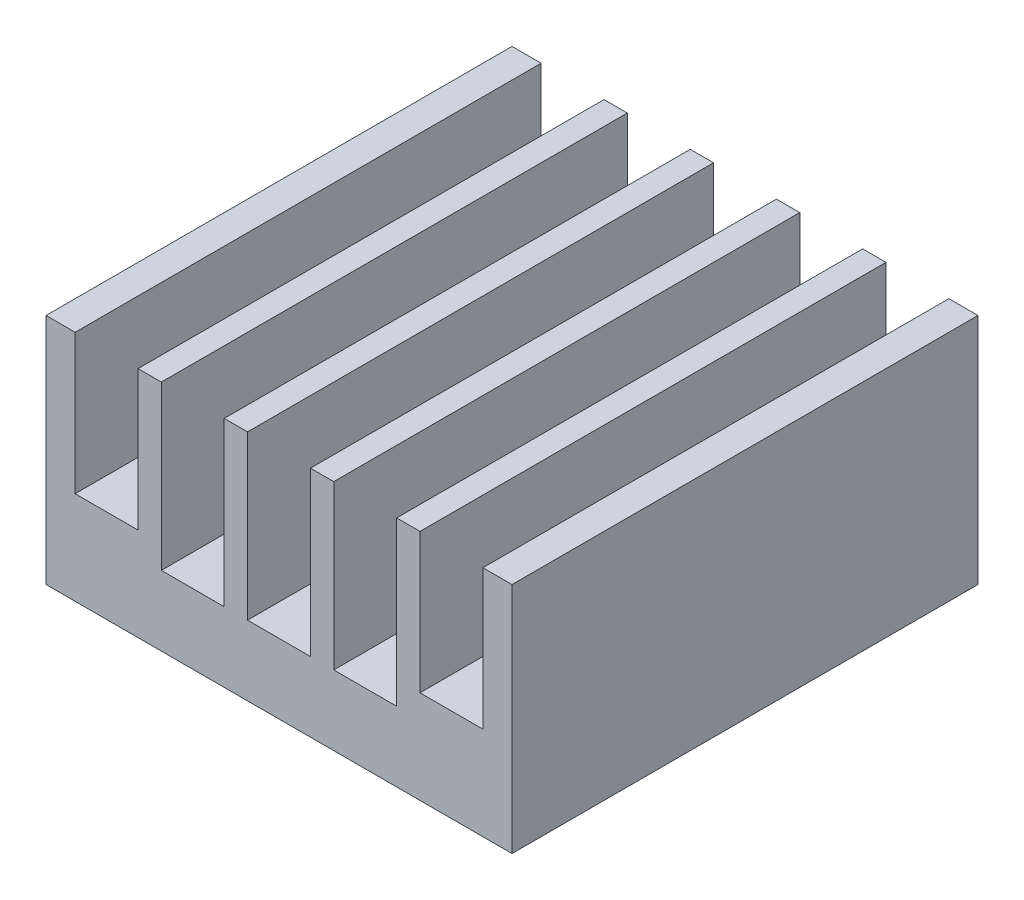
from build123d import *

# Parameters (mm, degrees)
BOSS_EXTRU_1_DEPTH = 40


with BuildPart() as part:
    # Esquisse1 → Boss.-Extru.1 (new body)
    with BuildSketch(Plane.XY):
        Polygon((-20, 0), (20, 0), (20, 20), (17.5, 20), (17.5, 8), (12.1, 8), (12.1, 20), (10.1, 20), (10.1, 6), (4.7, 6), (4.7, 20), (2.7, 20), (2.7, 6), (-2.7, 6), (-2.7, 20), (-4.7, 20), (-4.7, 6), (-10.1, 6), (-10.1, 20), (-12.1, 20), (-12.1, 8), (-17.5, 8), (-17.5, 20), (-20, 20), align=None)
    extrude(amount=BOSS_EXTRU_1_DEPTH)


solid = part.part
